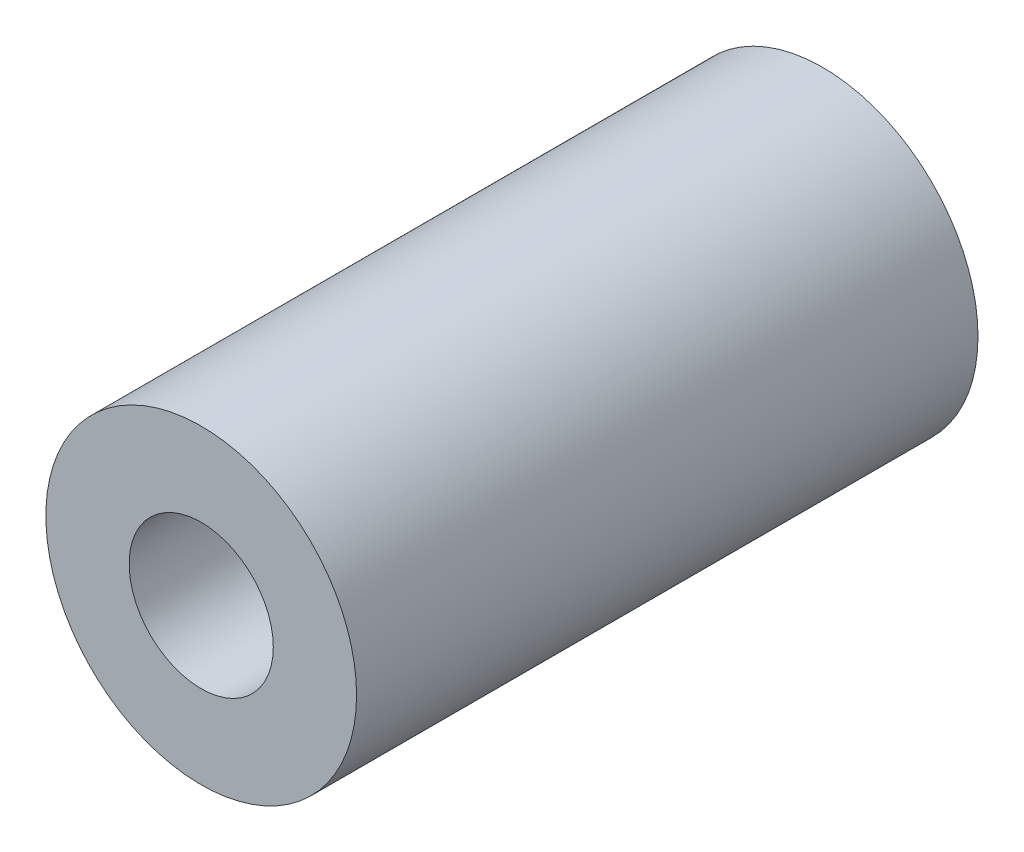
from build123d import *

# Parameters (mm, degrees)
SKETCH1_R             = 3.175
BOSS_EXTRUDE1_DEPTH   = 12.7
F_4_CLEARANCE_HOLE1_D = 2.9464


with BuildPart() as part:
    # Sketch1 → Boss-Extrude1 (new body)
    with BuildSketch(Plane.XY):
        Circle(SKETCH1_R)
    extrude(amount=BOSS_EXTRUDE1_DEPTH)

    # 4 Clearance Hole1 (through all)
    with Locations(Plane.XY.offset(12.7)):
        with Locations((0, 0)):
            Hole(F_4_CLEARANCE_HOLE1_D / 2)


solid = part.part
